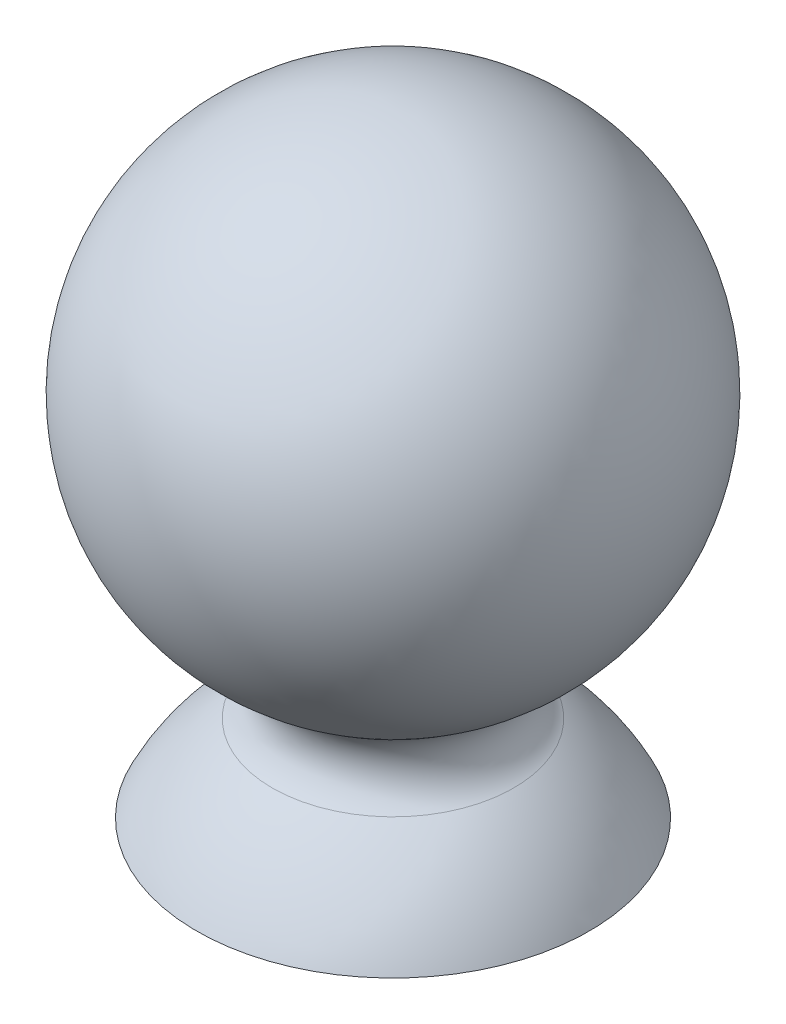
from build123d import *

# Parameters (mm, degrees)
SKETCH2_W          = 10.5
SKETCH2_H          = 10.5
CUT_EXTRUDE1_DEPTH = 5.5
CUT_EXTRUDE2_DEPTH = 4


with BuildPart() as part:
    # Sketch1 → Revolve1 (revolve)
    with BuildSketch(Plane.XY, mode=Mode.PRIVATE) as revolve1_sk:
        with BuildLine():
            Line((0, 30), (0, -30))
            Line((0, -30), (0, -45))
            Line((0, -45), (-24, -45))
            ThreePointArc((-24, -45), (-20.088427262, -39.111791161), (-14.768717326, -34.45646187))
            ThreePointArc((-14.768717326, -34.45646187), (-12.53674995, -30.137556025), (-15.029481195, -25.963718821))
            ThreePointArc((-15.029481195, -25.963718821), (-28.973363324, 7.781016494), (0, 30))
        make_face()
    revolve(revolve1_sk.sketch.rotate(Axis((0, 30, 0), (0, -1, 0)), 270), axis=Axis((0, 30, 0), (0, -1, 0)))

    # Sketch2 → Cut-Extrude1 (cut)
    with BuildSketch(Plane.XZ.offset(45)):
        Rectangle(SKETCH2_W, SKETCH2_H)
    extrude(amount=-CUT_EXTRUDE1_DEPTH, mode=Mode.SUBTRACT)

    # Sketch4 → Cut-Extrude2 (cut)
    with BuildSketch(Plane.XZ.offset(45)):
        with BuildLine():
            Line((-17, 13), (-17, 10))
            ThreePointArc((-17, 10), (-15.565150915, 10.301241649), (-14.124974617, 10.575888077))
            ThreePointArc((-14.124974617, 10.575888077), (-14.827114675, 0), (-14.124974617, -10.575888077))
            ThreePointArc((-14.124974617, -10.575888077), (-15.565150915, -10.301241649), (-17, -10))
            Line((-17, -10), (-17, -13))
            ThreePointArc((-17, -13), (-15.330185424, -13.344535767), (-13.653407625, -13.653407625))
            ThreePointArc((-13.653407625, -13.653407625), (-13.344535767, -15.330185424), (-13, -17))
            Line((-13, -17), (-10, -17))
            ThreePointArc((-10, -17), (-10.301241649, -15.565150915), (-10.575888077, -14.124974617))
            ThreePointArc((-10.575888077, -14.124974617), (0, -14.827114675), (10.575888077, -14.124974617))
            ThreePointArc((10.575888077, -14.124974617), (10.301241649, -15.565150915), (10, -17))
            Line((10, -17), (13, -17))
            ThreePointArc((13, -17), (13.344535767, -15.330185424), (13.653407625, -13.653407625))
            ThreePointArc((13.653407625, -13.653407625), (15.330185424, -13.344535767), (17, -13))
            Line((17, -13), (17, -10))
            ThreePointArc((17, -10), (15.565150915, -10.301241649), (14.124974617, -10.575888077))
            ThreePointArc((14.124974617, -10.575888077), (14.827114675, 0), (14.124974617, 10.575888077))
            ThreePointArc((14.124974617, 10.575888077), (15.565150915, 10.301241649), (17, 10))
            Line((17, 10), (17, 13))
            ThreePointArc((17, 13), (15.330185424, 13.344535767), (13.653407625, 13.653407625))
            ThreePointArc((13.653407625, 13.653407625), (13.344535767, 15.330185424), (13, 17))
            Line((13, 17), (10, 17))
            ThreePointArc((10, 17), (10.301241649, 15.565150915), (10.575888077, 14.124974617))
            ThreePointArc((10.575888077, 14.124974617), (0, 14.827114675), (-10.575888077, 14.124974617))
            ThreePointArc((-10.575888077, 14.124974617), (-10.301241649, 15.565150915), (-10, 17))
            Line((-10, 17), (-13, 17))
            ThreePointArc((-13, 17), (-13.344535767, 15.330185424), (-13.653407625, 13.653407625))
            ThreePointArc((-13.653407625, 13.653407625), (-15.330185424, 13.344535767), (-17, 13))
        make_face()
        with BuildLine():
            ThreePointArc((-11.068118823, 11.068118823), (0, 11.844816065), (11.068118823, 11.068118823))
            ThreePointArc((11.068118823, 11.068118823), (11.844816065, 0), (11.068118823, -11.068118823))
            ThreePointArc((11.068118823, -11.068118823), (0, -11.844816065), (-11.068118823, -11.068118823))
            ThreePointArc((-11.068118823, -11.068118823), (-11.844816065, 0), (-11.068118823, 11.068118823))
        make_face(mode=Mode.SUBTRACT)
    extrude(amount=-CUT_EXTRUDE2_DEPTH, mode=Mode.SUBTRACT)


solid = part.part
